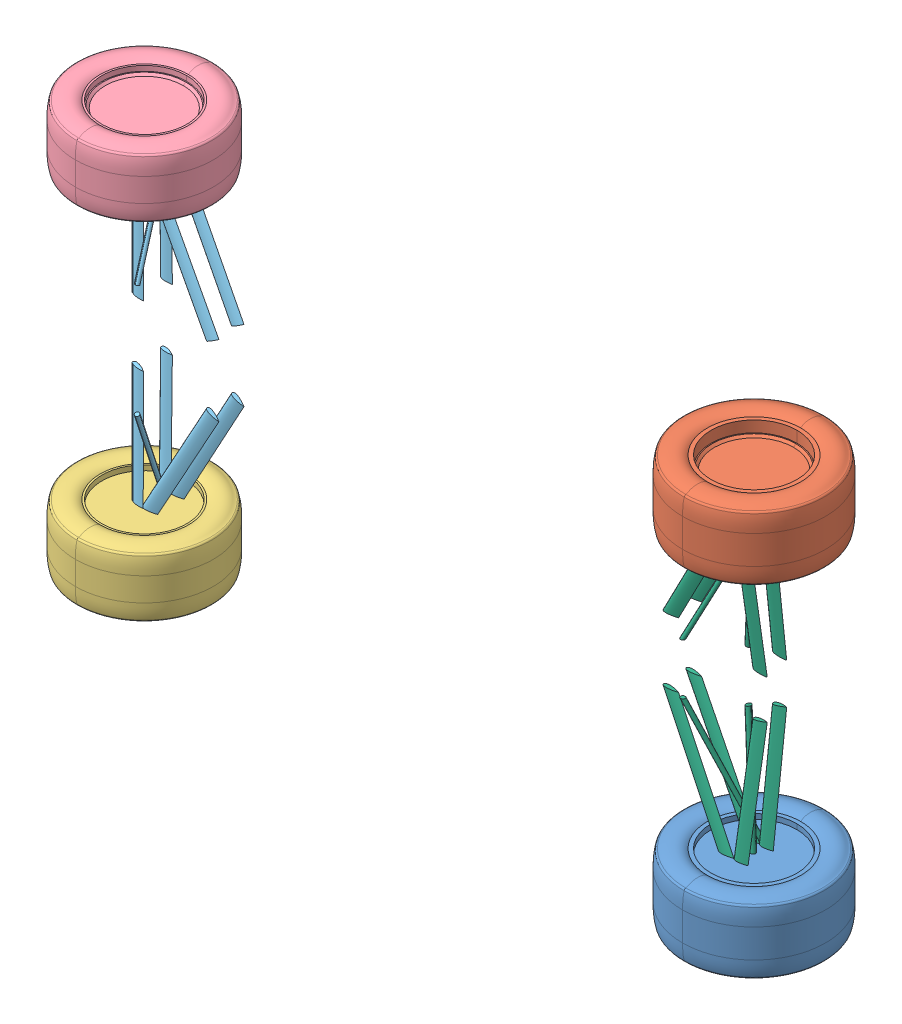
SolidWorks assembly cfd_parts_2018.SLDASM, configuration Default (file format 11000). Lengths in mm.
Overall size (3687.5 2017.02 700).
6 component instances, 6 part files, 0 mates.
Components (placement in the parent):
- Wheel_RL-1: Wheel_RL.sldprt [Default] at origin size (700 347.02 700)
- Wheel_RR-1: Wheel_RR.sldprt [Default] at origin size (700 347.02 700)
- Wheel_FL-1: Wheel_FL.sldprt [Default] at origin size (675 322.02 675)
- Wheel_FR-1: Wheel_FR.sldprt [Default] at origin size (675 322.02 675)
- Front_suspension_CFD-1: Front_suspension_CFD.sldprt [Default] at origin size (444.57 1500.46 240.96)
- Rear_sispension_CFD-1: Rear_sispension_CFD.sldprt [Default] at origin size (493.36 1648.83 210.83)
